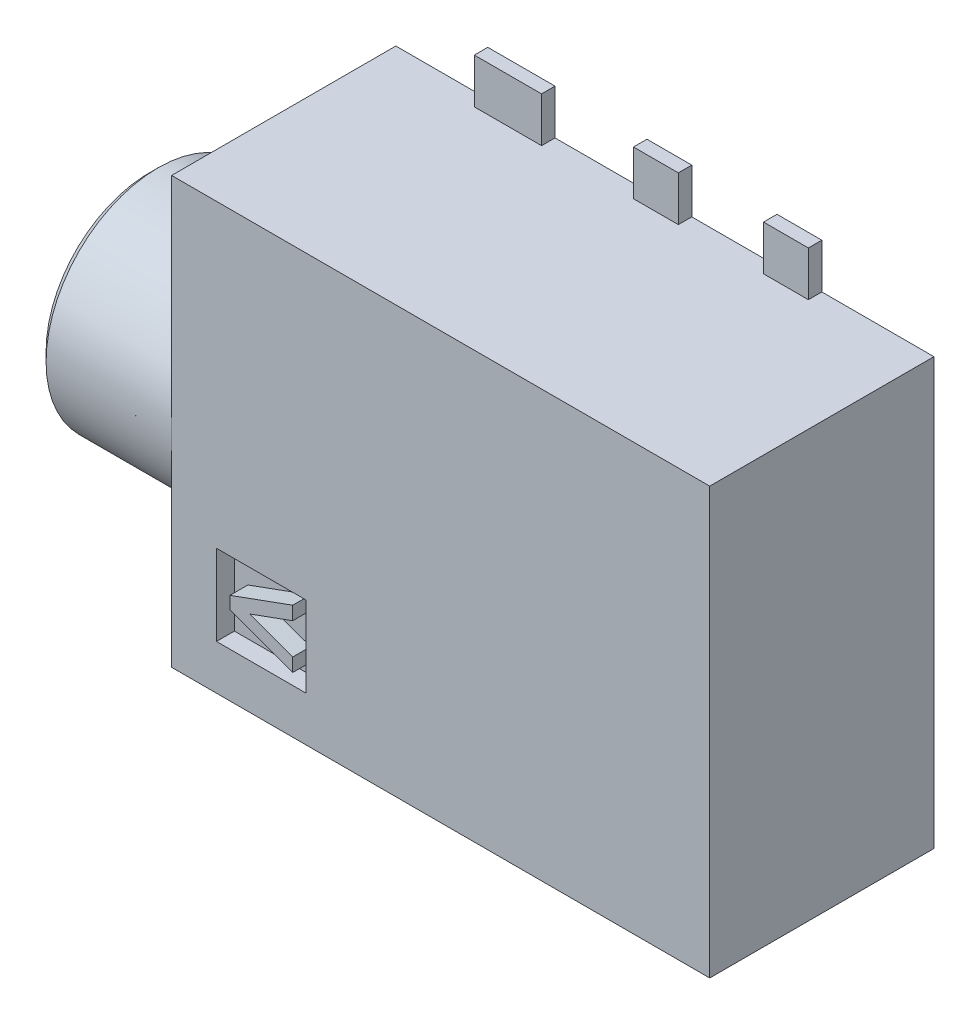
ISO-10303-21;
HEADER;
FILE_DESCRIPTION(('STEP AP214'),'2;1');
FILE_NAME('part.step','',(''),(''),'','','');
FILE_SCHEMA(('AUTOMOTIVE_DESIGN { 1 0 10303 214 1 1 1 1 }'));
ENDSEC;
DATA;
#1=APPLICATION_CONTEXT('core data for automotive mechanical design processes');
#2=APPLICATION_PROTOCOL_DEFINITION('international standard','automotive_design',2000,#1);
#3=PRODUCT_CONTEXT('',#1,'mechanical');
#4=PRODUCT('Part','Part','',(#3));
#5=PRODUCT_RELATED_PRODUCT_CATEGORY('part','',(#4));
#6=PRODUCT_DEFINITION_FORMATION('','',#4);
#7=PRODUCT_DEFINITION_CONTEXT('part definition',#1,'design');
#8=PRODUCT_DEFINITION('design','',#6,#7);
#9=PRODUCT_DEFINITION_SHAPE('','',#8);
#10=(LENGTH_UNIT() NAMED_UNIT(*) SI_UNIT(.MILLI.,.METRE.));
#11=(NAMED_UNIT(*) PLANE_ANGLE_UNIT() SI_UNIT($,.RADIAN.));
#12=(NAMED_UNIT(*) SI_UNIT($,.STERADIAN.) SOLID_ANGLE_UNIT());
#13=UNCERTAINTY_MEASURE_WITH_UNIT(LENGTH_MEASURE(1.E-05),#10,'distance_accuracy_value','');
#14=(GEOMETRIC_REPRESENTATION_CONTEXT(3) GLOBAL_UNCERTAINTY_ASSIGNED_CONTEXT((#13)) GLOBAL_UNIT_ASSIGNED_CONTEXT((#10,
#11,#12)) REPRESENTATION_CONTEXT('',''));
#15=CARTESIAN_POINT('',(0.,0.,0.));
#16=DIRECTION('',(0.,0.,1.));
#17=DIRECTION('',(1.,0.,0.));
#18=AXIS2_PLACEMENT_3D('',#15,#16,#17);
#19=CARTESIAN_POINT('',(11.,2.6784,0.6784));
#20=DIRECTION('',(-1.,0.,0.));
#21=DIRECTION('',(0.,0.,1.));
#22=AXIS2_PLACEMENT_3D('',#19,#20,#21);
#23=PLANE('',#22);
#24=CARTESIAN_POINT('',(11.,4.5,2.5));
#25=DIRECTION('',(1.,0.,0.));
#26=DIRECTION('',(0.,0.,-1.));
#27=AXIS2_PLACEMENT_3D('',#24,#25,#26);
#28=CIRCLE('',#27,1.8);
#29=CARTESIAN_POINT('',(11.,4.5,0.7));
#30=VERTEX_POINT('',#29);
#31=EDGE_CURVE('E20',#30,#30,#28,.T.);
#32=ORIENTED_EDGE('',*,*,#31,.F.);
#33=EDGE_LOOP('',(#32));
#34=FACE_BOUND('',#33,.T.);
#35=ADVANCED_FACE('F16',(#34),#23,.T.);
#36=CARTESIAN_POINT('',(-2.8,4.5,2.5));
#37=DIRECTION('',(1.,0.,0.));
#38=DIRECTION('',(0.,0.,-1.));
#39=AXIS2_PLACEMENT_3D('',#36,#37,#38);
#40=CYLINDRICAL_SURFACE('',#39,1.8);
#41=CARTESIAN_POINT('',(-2.79999999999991,4.5,2.5));
#42=DIRECTION('',(-1.,0.,0.));
#43=DIRECTION('',(0.,0.,1.));
#44=AXIS2_PLACEMENT_3D('',#41,#42,#43);
#45=CIRCLE('',#44,1.8);
#46=CARTESIAN_POINT('',(-2.8,4.5,4.3));
#47=VERTEX_POINT('',#46);
#48=EDGE_CURVE('E335',#47,#47,#45,.F.);
#49=ORIENTED_EDGE('',*,*,#48,.F.);
#50=EDGE_LOOP('',(#49));
#51=FACE_BOUND('',#50,.T.);
#52=ORIENTED_EDGE('',*,*,#31,.T.);
#53=EDGE_LOOP('',(#52));
#54=FACE_BOUND('',#53,.T.);
#55=ADVANCED_FACE('F758',(#51,#54),#40,.F.);
#56=CARTESIAN_POINT('',(2.7,1.25,5.));
#57=DIRECTION('',(0.,0.,-1.));
#58=DIRECTION('',(-1.,0.,0.));
#59=AXIS2_PLACEMENT_3D('',#56,#57,#58);
#60=PLANE('',#59);
#61=DIRECTION('',(0.939692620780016,0.342020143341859,0.));
#62=VECTOR('',#61,1.);
#63=CARTESIAN_POINT('',(2.,2.295220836,5.));
#64=LINE('',#63,#62);
#65=CARTESIAN_POINT('',(1.3,2.04044167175,5.));
#66=VERTEX_POINT('',#65);
#67=CARTESIAN_POINT('',(2.7,2.55,5.));
#68=VERTEX_POINT('',#67);
#69=EDGE_CURVE('E317',#66,#68,#64,.T.);
#70=ORIENTED_EDGE('',*,*,#69,.F.);
#71=DIRECTION('',(0.,1.,0.));
#72=VECTOR('',#71,1.);
#73=CARTESIAN_POINT('',(1.3,1.9,5.));
#74=LINE('',#73,#72);
#75=CARTESIAN_POINT('',(1.3,1.75955832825,5.));
#76=VERTEX_POINT('',#75);
#77=EDGE_CURVE('E318',#76,#66,#74,.T.);
#78=ORIENTED_EDGE('',*,*,#77,.F.);
#79=DIRECTION('',(-0.939692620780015,0.342020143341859,0.));
#80=VECTOR('',#79,1.);
#81=CARTESIAN_POINT('',(2.,1.504779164,5.));
#82=LINE('',#81,#80);
#83=CARTESIAN_POINT('',(2.7,1.25,5.));
#84=VERTEX_POINT('',#83);
#85=EDGE_CURVE('E322',#84,#76,#82,.T.);
#86=ORIENTED_EDGE('',*,*,#85,.F.);
#87=DIRECTION('',(0.,-1.,0.));
#88=VECTOR('',#87,1.);
#89=CARTESIAN_POINT('',(2.7,1.4,5.));
#90=LINE('',#89,#88);
#91=CARTESIAN_POINT('',(2.7,1.55000000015,5.));
#92=VERTEX_POINT('',#91);
#93=EDGE_CURVE('E260',#92,#84,#90,.T.);
#94=ORIENTED_EDGE('',*,*,#93,.F.);
#95=DIRECTION('',(0.939692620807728,-0.342020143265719,0.));
#96=VECTOR('',#95,1.);
#97=CARTESIAN_POINT('',(2.2191914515,1.725,5.));
#98=LINE('',#97,#96);
#99=CARTESIAN_POINT('',(1.73838290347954,1.90000000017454,5.));
#100=VERTEX_POINT('',#99);
#101=EDGE_CURVE('E261',#100,#92,#98,.T.);
#102=ORIENTED_EDGE('',*,*,#101,.F.);
#103=DIRECTION('',(-0.939692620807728,-0.342020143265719,0.));
#104=VECTOR('',#103,1.);
#105=CARTESIAN_POINT('',(2.2191914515,2.075,5.));
#106=LINE('',#105,#104);
#107=CARTESIAN_POINT('',(2.7,2.24999999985,5.));
#108=VERTEX_POINT('',#107);
#109=EDGE_CURVE('E257',#108,#100,#106,.T.);
#110=ORIENTED_EDGE('',*,*,#109,.F.);
#111=DIRECTION('',(0.,-1.,0.));
#112=VECTOR('',#111,1.);
#113=CARTESIAN_POINT('',(2.7,1.9,5.));
#114=LINE('',#113,#112);
#115=EDGE_CURVE('E338',#68,#108,#114,.T.);
#116=ORIENTED_EDGE('',*,*,#115,.F.);
#117=EDGE_LOOP('',(#70,#78,#86,#94,#102,#110,#116));
#118=FACE_BOUND('',#117,.T.);
#119=ADVANCED_FACE('F756',(#118),#60,.F.);
#120=CARTESIAN_POINT('',(-2.8,4.5,2.5));
#121=DIRECTION('',(-1.,0.,0.));
#122=DIRECTION('',(0.,0.,1.));
#123=AXIS2_PLACEMENT_3D('',#120,#121,#122);
#124=CONICAL_SURFACE('',#123,1.8,0.785398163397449);
#125=ORIENTED_EDGE('',*,*,#48,.T.);
#126=EDGE_LOOP('',(#125));
#127=FACE_BOUND('',#126,.T.);
#128=CARTESIAN_POINT('',(-2.99999999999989,4.5,2.5));
#129=DIRECTION('',(-1.,0.,0.));
#130=DIRECTION('',(0.,0.,1.));
#131=AXIS2_PLACEMENT_3D('',#128,#129,#130);
#132=CIRCLE('',#131,1.99999999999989);
#133=CARTESIAN_POINT('',(-2.99999999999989,4.5,4.49999999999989));
#134=VERTEX_POINT('',#133);
#135=EDGE_CURVE('E279',#134,#134,#132,.F.);
#136=ORIENTED_EDGE('',*,*,#135,.F.);
#137=EDGE_LOOP('',(#136));
#138=FACE_BOUND('',#137,.T.);
#139=ADVANCED_FACE('F753',(#127,#138),#124,.F.);
#140=CARTESIAN_POINT('',(1.738382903,1.9,4.6));
#141=DIRECTION('',(0.34202014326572,-0.939692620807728,0.));
#142=DIRECTION('',(0.939692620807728,0.34202014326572,0.));
#143=AXIS2_PLACEMENT_3D('',#140,#141,#142);
#144=PLANE('',#143);
#145=DIRECTION('',(-0.93969262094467,-0.342020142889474,0.));
#146=VECTOR('',#145,1.);
#147=CARTESIAN_POINT('',(2.7,2.2499999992,4.6));
#148=LINE('',#147,#146);
#149=CARTESIAN_POINT('',(2.7,2.2499999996,4.6));
#150=VERTEX_POINT('',#149);
#151=CARTESIAN_POINT('',(1.73838290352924,1.89999999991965,4.6));
#152=VERTEX_POINT('',#151);
#153=EDGE_CURVE('E249',#150,#152,#148,.T.);
#154=ORIENTED_EDGE('',*,*,#153,.F.);
#155=DIRECTION('',(0.,0.,-1.));
#156=VECTOR('',#155,1.);
#157=CARTESIAN_POINT('',(2.7,2.25,4.8));
#158=LINE('',#157,#156);
#159=EDGE_CURVE('E325',#108,#150,#158,.T.);
#160=ORIENTED_EDGE('',*,*,#159,.F.);
#161=ORIENTED_EDGE('',*,*,#109,.T.);
#162=DIRECTION('',(0.,0.,1.));
#163=VECTOR('',#162,1.);
#164=CARTESIAN_POINT('',(1.738382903,1.9,4.8));
#165=LINE('',#164,#163);
#166=EDGE_CURVE('E253',#152,#100,#165,.T.);
#167=ORIENTED_EDGE('',*,*,#166,.F.);
#168=EDGE_LOOP('',(#154,#160,#161,#167));
#169=FACE_BOUND('',#168,.T.);
#170=ADVANCED_FACE('F255',(#169),#144,.T.);
#171=CARTESIAN_POINT('',(2.7,1.55,4.6));
#172=DIRECTION('',(0.342020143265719,0.939692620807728,0.));
#173=DIRECTION('',(-0.939692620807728,0.342020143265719,0.));
#174=AXIS2_PLACEMENT_3D('',#171,#172,#173);
#175=PLANE('',#174);
#176=DIRECTION('',(0.93969262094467,-0.342020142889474,0.));
#177=VECTOR('',#176,1.);
#178=CARTESIAN_POINT('',(1.738382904,1.9,4.6));
#179=LINE('',#178,#177);
#180=CARTESIAN_POINT('',(2.7,1.5500000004,4.6));
#181=VERTEX_POINT('',#180);
#182=EDGE_CURVE('E264',#152,#181,#179,.T.);
#183=ORIENTED_EDGE('',*,*,#182,.F.);
#184=ORIENTED_EDGE('',*,*,#166,.T.);
#185=ORIENTED_EDGE('',*,*,#101,.T.);
#186=DIRECTION('',(0.,0.,1.));
#187=VECTOR('',#186,1.);
#188=CARTESIAN_POINT('',(2.7,1.55,4.8));
#189=LINE('',#188,#187);
#190=EDGE_CURVE('E267',#181,#92,#189,.T.);
#191=ORIENTED_EDGE('',*,*,#190,.F.);
#192=EDGE_LOOP('',(#183,#184,#185,#191));
#193=FACE_BOUND('',#192,.T.);
#194=ADVANCED_FACE('F265',(#193),#175,.T.);
#195=CARTESIAN_POINT('',(2.7,1.25,5.));
#196=DIRECTION('',(1.,0.,0.));
#197=DIRECTION('',(0.,0.,-1.));
#198=AXIS2_PLACEMENT_3D('',#195,#196,#197);
#199=PLANE('',#198);
#200=DIRECTION('',(0.,-1.,0.));
#201=VECTOR('',#200,1.);
#202=CARTESIAN_POINT('',(2.7,1.9,4.6));
#203=LINE('',#202,#201);
#204=CARTESIAN_POINT('',(2.7,1.2500000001,4.6));
#205=VERTEX_POINT('',#204);
#206=EDGE_CURVE('E271',#181,#205,#203,.T.);
#207=ORIENTED_EDGE('',*,*,#206,.F.);
#208=ORIENTED_EDGE('',*,*,#190,.T.);
#209=ORIENTED_EDGE('',*,*,#93,.T.);
#210=DIRECTION('',(0.,0.,1.));
#211=VECTOR('',#210,1.);
#212=CARTESIAN_POINT('',(2.7,1.25,4.8));
#213=LINE('',#212,#211);
#214=EDGE_CURVE('E319',#205,#84,#213,.T.);
#215=ORIENTED_EDGE('',*,*,#214,.F.);
#216=EDGE_LOOP('',(#207,#208,#209,#215));
#217=FACE_BOUND('',#216,.T.);
#218=ADVANCED_FACE('F772',(#217),#199,.T.);
#219=CARTESIAN_POINT('',(1.3,1.759558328,4.6));
#220=DIRECTION('',(-0.342020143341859,-0.939692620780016,0.));
#221=DIRECTION('',(0.939692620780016,-0.342020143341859,0.));
#222=AXIS2_PLACEMENT_3D('',#219,#220,#221);
#223=PLANE('',#222);
#224=DIRECTION('',(-0.939692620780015,0.342020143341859,0.));
#225=VECTOR('',#224,1.);
#226=CARTESIAN_POINT('',(2.7,1.2500000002,4.6));
#227=LINE('',#226,#225);
#228=CARTESIAN_POINT('',(1.3,1.7595583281,4.6));
#229=VERTEX_POINT('',#228);
#230=EDGE_CURVE('E284',#205,#229,#227,.T.);
#231=ORIENTED_EDGE('',*,*,#230,.F.);
#232=ORIENTED_EDGE('',*,*,#214,.T.);
#233=ORIENTED_EDGE('',*,*,#85,.T.);
#234=DIRECTION('',(0.,0.,1.));
#235=VECTOR('',#234,1.);
#236=CARTESIAN_POINT('',(1.3,1.759558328,4.8));
#237=LINE('',#236,#235);
#238=EDGE_CURVE('E314',#229,#76,#237,.T.);
#239=ORIENTED_EDGE('',*,*,#238,.F.);
#240=EDGE_LOOP('',(#231,#232,#233,#239));
#241=FACE_BOUND('',#240,.T.);
#242=ADVANCED_FACE('F775',(#241),#223,.T.);
#243=CARTESIAN_POINT('',(1.3,1.759558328,4.6));
#244=DIRECTION('',(-1.,0.,0.));
#245=DIRECTION('',(0.,0.,1.));
#246=AXIS2_PLACEMENT_3D('',#243,#244,#245);
#247=PLANE('',#246);
#248=DIRECTION('',(0.,1.,0.));
#249=VECTOR('',#248,1.);
#250=CARTESIAN_POINT('',(1.3,1.9,4.6));
#251=LINE('',#250,#249);
#252=CARTESIAN_POINT('',(1.3,2.0404416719,4.6));
#253=VERTEX_POINT('',#252);
#254=EDGE_CURVE('E287',#229,#253,#251,.T.);
#255=ORIENTED_EDGE('',*,*,#254,.F.);
#256=ORIENTED_EDGE('',*,*,#238,.T.);
#257=ORIENTED_EDGE('',*,*,#77,.T.);
#258=DIRECTION('',(0.,0.,1.));
#259=VECTOR('',#258,1.);
#260=CARTESIAN_POINT('',(1.3,2.040441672,4.8));
#261=LINE('',#260,#259);
#262=EDGE_CURVE('E327',#253,#66,#261,.T.);
#263=ORIENTED_EDGE('',*,*,#262,.F.);
#264=EDGE_LOOP('',(#255,#256,#257,#263));
#265=FACE_BOUND('',#264,.T.);
#266=ADVANCED_FACE('F779',(#265),#247,.T.);
#267=CARTESIAN_POINT('',(2.7,2.55,4.6));
#268=DIRECTION('',(-0.342020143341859,0.939692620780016,0.));
#269=DIRECTION('',(-0.939692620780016,-0.342020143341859,0.));
#270=AXIS2_PLACEMENT_3D('',#267,#268,#269);
#271=PLANE('',#270);
#272=DIRECTION('',(0.939692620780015,0.342020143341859,0.));
#273=VECTOR('',#272,1.);
#274=CARTESIAN_POINT('',(1.3,2.0404416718,4.6));
#275=LINE('',#274,#273);
#276=CARTESIAN_POINT('',(2.7,2.5499999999,4.6));
#277=VERTEX_POINT('',#276);
#278=EDGE_CURVE('E288',#253,#277,#275,.T.);
#279=ORIENTED_EDGE('',*,*,#278,.F.);
#280=ORIENTED_EDGE('',*,*,#262,.T.);
#281=ORIENTED_EDGE('',*,*,#69,.T.);
#282=DIRECTION('',(0.,0.,1.));
#283=VECTOR('',#282,1.);
#284=CARTESIAN_POINT('',(2.7,2.55,4.8));
#285=LINE('',#284,#283);
#286=EDGE_CURVE('E282',#277,#68,#285,.T.);
#287=ORIENTED_EDGE('',*,*,#286,.F.);
#288=EDGE_LOOP('',(#279,#280,#281,#287));
#289=FACE_BOUND('',#288,.T.);
#290=ADVANCED_FACE('F783',(#289),#271,.T.);
#291=CARTESIAN_POINT('',(2.7,2.25,5.));
#292=DIRECTION('',(1.,0.,0.));
#293=DIRECTION('',(0.,0.,-1.));
#294=AXIS2_PLACEMENT_3D('',#291,#292,#293);
#295=PLANE('',#294);
#296=DIRECTION('',(0.,-1.,0.));
#297=VECTOR('',#296,1.);
#298=CARTESIAN_POINT('',(2.7,1.9,4.6));
#299=LINE('',#298,#297);
#300=EDGE_CURVE('E278',#277,#150,#299,.T.);
#301=ORIENTED_EDGE('',*,*,#300,.F.);
#302=ORIENTED_EDGE('',*,*,#286,.T.);
#303=ORIENTED_EDGE('',*,*,#115,.T.);
#304=ORIENTED_EDGE('',*,*,#159,.T.);
#305=EDGE_LOOP('',(#301,#302,#303,#304));
#306=FACE_BOUND('',#305,.T.);
#307=ADVANCED_FACE('F787',(#306),#295,.T.);
#308=CARTESIAN_POINT('',(-3.,2.1724,0.1724));
#309=DIRECTION('',(-1.,0.,0.));
#310=DIRECTION('',(0.,0.,1.));
#311=AXIS2_PLACEMENT_3D('',#308,#309,#310);
#312=PLANE('',#311);
#313=ORIENTED_EDGE('',*,*,#135,.T.);
#314=EDGE_LOOP('',(#313));
#315=FACE_BOUND('',#314,.T.);
#316=CARTESIAN_POINT('',(-2.99999999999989,4.5,2.5));
#317=DIRECTION('',(1.,0.,0.));
#318=DIRECTION('',(0.,0.,-1.));
#319=AXIS2_PLACEMENT_3D('',#316,#317,#318);
#320=CIRCLE('',#319,2.30000000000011);
#321=CARTESIAN_POINT('',(-2.99999999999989,4.5,0.199999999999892));
#322=VERTEX_POINT('',#321);
#323=EDGE_CURVE('E290',#322,#322,#320,.F.);
#324=ORIENTED_EDGE('',*,*,#323,.T.);
#325=EDGE_LOOP('',(#324));
#326=FACE_BOUND('',#325,.T.);
#327=ADVANCED_FACE('F791',(#315,#326),#312,.T.);
#328=CARTESIAN_POINT('',(1.,1.,4.6));
#329=DIRECTION('',(0.,0.,1.));
#330=DIRECTION('',(1.,0.,0.));
#331=AXIS2_PLACEMENT_3D('',#328,#329,#330);
#332=PLANE('',#331);
#333=ORIENTED_EDGE('',*,*,#278,.T.);
#334=ORIENTED_EDGE('',*,*,#300,.T.);
#335=ORIENTED_EDGE('',*,*,#153,.T.);
#336=ORIENTED_EDGE('',*,*,#182,.T.);
#337=ORIENTED_EDGE('',*,*,#206,.T.);
#338=ORIENTED_EDGE('',*,*,#230,.T.);
#339=ORIENTED_EDGE('',*,*,#254,.T.);
#340=EDGE_LOOP('',(#333,#334,#335,#336,#337,#338,#339));
#341=FACE_BOUND('',#340,.T.);
#342=DIRECTION('',(0.,1.,0.));
#343=VECTOR('',#342,1.);
#344=CARTESIAN_POINT('',(3.,1.9,4.6));
#345=LINE('',#344,#343);
#346=CARTESIAN_POINT('',(3.,1.,4.6));
#347=VERTEX_POINT('',#346);
#348=CARTESIAN_POINT('',(3.,2.8,4.6));
#349=VERTEX_POINT('',#348);
#350=EDGE_CURVE('E293',#347,#349,#345,.T.);
#351=ORIENTED_EDGE('',*,*,#350,.T.);
#352=DIRECTION('',(-1.,0.,0.));
#353=VECTOR('',#352,1.);
#354=CARTESIAN_POINT('',(2.,2.8,4.6));
#355=LINE('',#354,#353);
#356=CARTESIAN_POINT('',(1.,2.8,4.6));
#357=VERTEX_POINT('',#356);
#358=EDGE_CURVE('E359',#349,#357,#355,.T.);
#359=ORIENTED_EDGE('',*,*,#358,.T.);
#360=DIRECTION('',(0.,-1.,0.));
#361=VECTOR('',#360,1.);
#362=CARTESIAN_POINT('',(1.,1.9,4.6));
#363=LINE('',#362,#361);
#364=CARTESIAN_POINT('',(1.,1.,4.6));
#365=VERTEX_POINT('',#364);
#366=EDGE_CURVE('E364',#357,#365,#363,.T.);
#367=ORIENTED_EDGE('',*,*,#366,.T.);
#368=DIRECTION('',(1.,0.,0.));
#369=VECTOR('',#368,1.);
#370=CARTESIAN_POINT('',(2.,1.,4.6));
#371=LINE('',#370,#369);
#372=EDGE_CURVE('E369',#365,#347,#371,.T.);
#373=ORIENTED_EDGE('',*,*,#372,.T.);
#374=EDGE_LOOP('',(#351,#359,#367,#373));
#375=FACE_BOUND('',#374,.T.);
#376=ADVANCED_FACE('F275',(#341,#375),#332,.T.);
#377=CARTESIAN_POINT('',(-3.,4.5,2.5));
#378=DIRECTION('',(1.,0.,0.));
#379=DIRECTION('',(0.,0.,-1.));
#380=AXIS2_PLACEMENT_3D('',#377,#378,#379);
#381=CONICAL_SURFACE('',#380,2.3,0.785398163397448);
#382=CARTESIAN_POINT('',(-2.8,4.5,2.5));
#383=DIRECTION('',(1.,0.,0.));
#384=DIRECTION('',(0.,0.,-1.));
#385=AXIS2_PLACEMENT_3D('',#382,#383,#384);
#386=CIRCLE('',#385,2.5);
#387=CARTESIAN_POINT('',(-2.8,4.5,0.));
#388=VERTEX_POINT('',#387);
#389=EDGE_CURVE('E350',#388,#388,#386,.F.);
#390=ORIENTED_EDGE('',*,*,#389,.T.);
#391=EDGE_LOOP('',(#390));
#392=FACE_BOUND('',#391,.T.);
#393=ORIENTED_EDGE('',*,*,#323,.F.);
#394=EDGE_LOOP('',(#393));
#395=FACE_BOUND('',#394,.T.);
#396=ADVANCED_FACE('F748',(#392,#395),#381,.T.);
#397=CARTESIAN_POINT('',(3.,1.,5.));
#398=DIRECTION('',(1.,0.,0.));
#399=DIRECTION('',(0.,0.,-1.));
#400=AXIS2_PLACEMENT_3D('',#397,#398,#399);
#401=PLANE('',#400);
#402=DIRECTION('',(0.,0.,-1.));
#403=VECTOR('',#402,1.);
#404=CARTESIAN_POINT('',(3.,2.8,4.8));
#405=LINE('',#404,#403);
#406=CARTESIAN_POINT('',(3.,2.79999999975,5.));
#407=VERTEX_POINT('',#406);
#408=EDGE_CURVE('E356',#407,#349,#405,.T.);
#409=ORIENTED_EDGE('',*,*,#408,.T.);
#410=ORIENTED_EDGE('',*,*,#350,.F.);
#411=DIRECTION('',(0.,0.,1.));
#412=VECTOR('',#411,1.);
#413=CARTESIAN_POINT('',(3.,1.,4.8));
#414=LINE('',#413,#412);
#415=CARTESIAN_POINT('',(3.,1.00000000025,5.));
#416=VERTEX_POINT('',#415);
#417=EDGE_CURVE('E354',#347,#416,#414,.T.);
#418=ORIENTED_EDGE('',*,*,#417,.T.);
#419=DIRECTION('',(0.,1.,0.));
#420=VECTOR('',#419,1.);
#421=CARTESIAN_POINT('',(3.,4.75,5.));
#422=LINE('',#421,#420);
#423=EDGE_CURVE('E353',#416,#407,#422,.T.);
#424=ORIENTED_EDGE('',*,*,#423,.T.);
#425=EDGE_LOOP('',(#409,#410,#418,#424));
#426=FACE_BOUND('',#425,.T.);
#427=ADVANCED_FACE('F751',(#426),#401,.F.);
#428=CARTESIAN_POINT('',(3.,2.8,4.6));
#429=DIRECTION('',(0.,1.,0.));
#430=DIRECTION('',(-1.,0.,0.));
#431=AXIS2_PLACEMENT_3D('',#428,#429,#430);
#432=PLANE('',#431);
#433=DIRECTION('',(0.,0.,-1.));
#434=VECTOR('',#433,1.);
#435=CARTESIAN_POINT('',(1.,2.8,4.8));
#436=LINE('',#435,#434);
#437=CARTESIAN_POINT('',(0.999999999,2.79999999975,5.));
#438=VERTEX_POINT('',#437);
#439=EDGE_CURVE('E361',#438,#357,#436,.T.);
#440=ORIENTED_EDGE('',*,*,#439,.T.);
#441=ORIENTED_EDGE('',*,*,#358,.F.);
#442=ORIENTED_EDGE('',*,*,#408,.F.);
#443=DIRECTION('',(-1.,0.,0.));
#444=VECTOR('',#443,1.);
#445=CARTESIAN_POINT('',(6.,2.799999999,5.));
#446=LINE('',#445,#444);
#447=EDGE_CURVE('E433',#407,#438,#446,.T.);
#448=ORIENTED_EDGE('',*,*,#447,.T.);
#449=EDGE_LOOP('',(#440,#441,#442,#448));
#450=FACE_BOUND('',#449,.T.);
#451=ADVANCED_FACE('F800',(#450),#432,.F.);
#452=CARTESIAN_POINT('',(1.,1.,4.6));
#453=DIRECTION('',(-1.,0.,0.));
#454=DIRECTION('',(0.,0.,1.));
#455=AXIS2_PLACEMENT_3D('',#452,#453,#454);
#456=PLANE('',#455);
#457=DIRECTION('',(0.,0.,-1.));
#458=VECTOR('',#457,1.);
#459=CARTESIAN_POINT('',(1.,1.,4.8));
#460=LINE('',#459,#458);
#461=CARTESIAN_POINT('',(0.999999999,1.00000000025,5.));
#462=VERTEX_POINT('',#461);
#463=EDGE_CURVE('E366',#462,#365,#460,.T.);
#464=ORIENTED_EDGE('',*,*,#463,.T.);
#465=ORIENTED_EDGE('',*,*,#366,.F.);
#466=ORIENTED_EDGE('',*,*,#439,.F.);
#467=DIRECTION('',(0.,-1.,0.));
#468=VECTOR('',#467,1.);
#469=CARTESIAN_POINT('',(0.999999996,4.75,5.));
#470=LINE('',#469,#468);
#471=EDGE_CURVE('E435',#438,#462,#470,.T.);
#472=ORIENTED_EDGE('',*,*,#471,.T.);
#473=EDGE_LOOP('',(#464,#465,#466,#472));
#474=FACE_BOUND('',#473,.T.);
#475=ADVANCED_FACE('F804',(#474),#456,.F.);
#476=CARTESIAN_POINT('',(1.,1.,5.));
#477=DIRECTION('',(0.,-1.,0.));
#478=DIRECTION('',(0.,0.,-1.));
#479=AXIS2_PLACEMENT_3D('',#476,#477,#478);
#480=PLANE('',#479);
#481=ORIENTED_EDGE('',*,*,#417,.F.);
#482=ORIENTED_EDGE('',*,*,#372,.F.);
#483=ORIENTED_EDGE('',*,*,#463,.F.);
#484=DIRECTION('',(1.,0.,0.));
#485=VECTOR('',#484,1.);
#486=CARTESIAN_POINT('',(6.,1.000000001,5.));
#487=LINE('',#486,#485);
#488=EDGE_CURVE('E298',#462,#416,#487,.T.);
#489=ORIENTED_EDGE('',*,*,#488,.T.);
#490=EDGE_LOOP('',(#481,#482,#483,#489));
#491=FACE_BOUND('',#490,.T.);
#492=ADVANCED_FACE('F808',(#491),#480,.F.);
#493=CARTESIAN_POINT('',(2.4434,3.9434,-0.6));
#494=DIRECTION('',(0.,0.,1.));
#495=DIRECTION('',(1.,0.,0.));
#496=AXIS2_PLACEMENT_3D('',#493,#494,#495);
#497=PLANE('',#496);
#498=CARTESIAN_POINT('',(3.,4.5,-0.600000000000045));
#499=DIRECTION('',(0.,0.,1.));
#500=DIRECTION('',(1.,0.,0.));
#501=AXIS2_PLACEMENT_3D('',#498,#499,#500);
#502=CIRCLE('',#501,0.549999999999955);
#503=CARTESIAN_POINT('',(3.54999999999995,4.5,-0.600000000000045));
#504=VERTEX_POINT('',#503);
#505=EDGE_CURVE('E294',#504,#504,#502,.F.);
#506=ORIENTED_EDGE('',*,*,#505,.T.);
#507=EDGE_LOOP('',(#506));
#508=FACE_BOUND('',#507,.T.);
#509=ADVANCED_FACE('F812',(#508),#497,.F.);
#510=CARTESIAN_POINT('',(4.4,-1.5,0.3));
#511=DIRECTION('',(0.,0.,1.));
#512=DIRECTION('',(1.,0.,0.));
#513=AXIS2_PLACEMENT_3D('',#510,#511,#512);
#514=PLANE('',#513);
#515=DIRECTION('',(1.,0.,0.));
#516=VECTOR('',#515,1.);
#517=CARTESIAN_POINT('',(4.9,-1.5,0.3));
#518=LINE('',#517,#516);
#519=CARTESIAN_POINT('',(4.4,-1.5,0.3));
#520=VERTEX_POINT('',#519);
#521=CARTESIAN_POINT('',(5.4,-1.5,0.3));
#522=VERTEX_POINT('',#521);
#523=EDGE_CURVE('E379',#520,#522,#518,.T.);
#524=ORIENTED_EDGE('',*,*,#523,.T.);
#525=DIRECTION('',(0.,1.,0.));
#526=VECTOR('',#525,1.);
#527=CARTESIAN_POINT('',(5.4,-0.75,0.3));
#528=LINE('',#527,#526);
#529=CARTESIAN_POINT('',(5.4,0.,0.3));
#530=VERTEX_POINT('',#529);
#531=EDGE_CURVE('E382',#522,#530,#528,.T.);
#532=ORIENTED_EDGE('',*,*,#531,.T.);
#533=DIRECTION('',(-1.,0.,0.));
#534=VECTOR('',#533,1.);
#535=CARTESIAN_POINT('',(6.,0.,0.3));
#536=LINE('',#535,#534);
#537=CARTESIAN_POINT('',(4.40000000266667,0.,0.3));
#538=VERTEX_POINT('',#537);
#539=EDGE_CURVE('E389',#530,#538,#536,.T.);
#540=ORIENTED_EDGE('',*,*,#539,.T.);
#541=DIRECTION('',(0.,-1.,0.));
#542=VECTOR('',#541,1.);
#543=CARTESIAN_POINT('',(4.4,-0.75,0.3));
#544=LINE('',#543,#542);
#545=EDGE_CURVE('E395',#538,#520,#544,.T.);
#546=ORIENTED_EDGE('',*,*,#545,.T.);
#547=EDGE_LOOP('',(#524,#532,#540,#546));
#548=FACE_BOUND('',#547,.T.);
#549=ADVANCED_FACE('F816',(#548),#514,.T.);
#550=CARTESIAN_POINT('',(8.55,-1.5,0.3));
#551=DIRECTION('',(0.,0.,1.));
#552=DIRECTION('',(1.,0.,0.));
#553=AXIS2_PLACEMENT_3D('',#550,#551,#552);
#554=PLANE('',#553);
#555=DIRECTION('',(1.,0.,0.));
#556=VECTOR('',#555,1.);
#557=CARTESIAN_POINT('',(9.3,-1.5,0.3));
#558=LINE('',#557,#556);
#559=CARTESIAN_POINT('',(8.55,-1.5,0.3));
#560=VERTEX_POINT('',#559);
#561=CARTESIAN_POINT('',(10.05,-1.5,0.3));
#562=VERTEX_POINT('',#561);
#563=EDGE_CURVE('E374',#560,#562,#558,.T.);
#564=ORIENTED_EDGE('',*,*,#563,.T.);
#565=DIRECTION('',(0.,1.,0.));
#566=VECTOR('',#565,1.);
#567=CARTESIAN_POINT('',(10.05,-0.75,0.3));
#568=LINE('',#567,#566);
#569=CARTESIAN_POINT('',(10.05,0.,0.3));
#570=VERTEX_POINT('',#569);
#571=EDGE_CURVE('E297',#562,#570,#568,.T.);
#572=ORIENTED_EDGE('',*,*,#571,.T.);
#573=DIRECTION('',(-1.,0.,0.));
#574=VECTOR('',#573,1.);
#575=CARTESIAN_POINT('',(6.,0.,0.3));
#576=LINE('',#575,#574);
#577=CARTESIAN_POINT('',(8.55,0.,0.3));
#578=VERTEX_POINT('',#577);
#579=EDGE_CURVE('E404',#570,#578,#576,.T.);
#580=ORIENTED_EDGE('',*,*,#579,.T.);
#581=DIRECTION('',(0.,-1.,0.));
#582=VECTOR('',#581,1.);
#583=CARTESIAN_POINT('',(8.55,-0.75,0.3));
#584=LINE('',#583,#582);
#585=EDGE_CURVE('E386',#578,#560,#584,.T.);
#586=ORIENTED_EDGE('',*,*,#585,.T.);
#587=EDGE_LOOP('',(#564,#572,#580,#586));
#588=FACE_BOUND('',#587,.T.);
#589=ADVANCED_FACE('F747',(#588),#554,.T.);
#590=CARTESIAN_POINT('',(-2.8,4.5,2.5));
#591=DIRECTION('',(1.,0.,0.));
#592=DIRECTION('',(0.,0.,-1.));
#593=AXIS2_PLACEMENT_3D('',#590,#591,#592);
#594=CYLINDRICAL_SURFACE('',#593,2.5);
#595=CARTESIAN_POINT('',(0.,4.5,2.5));
#596=DIRECTION('',(1.,0.,0.));
#597=DIRECTION('',(0.,0.,-1.));
#598=AXIS2_PLACEMENT_3D('',#595,#596,#597);
#599=CIRCLE('',#598,2.5);
#600=CARTESIAN_POINT('',(0.,4.50000000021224,5.));
#601=VERTEX_POINT('',#600);
#602=CARTESIAN_POINT('',(0.,4.5,0.));
#603=VERTEX_POINT('',#602);
#604=EDGE_CURVE('E304',#601,#603,#599,.F.);
#605=ORIENTED_EDGE('',*,*,#604,.T.);
#606=CARTESIAN_POINT('',(0.,4.5,2.5));
#607=DIRECTION('',(1.,0.,0.));
#608=DIRECTION('',(0.,0.,-1.));
#609=AXIS2_PLACEMENT_3D('',#606,#607,#608);
#610=CIRCLE('',#609,2.5);
#611=EDGE_CURVE('E299',#603,#601,#610,.F.);
#612=ORIENTED_EDGE('',*,*,#611,.T.);
#613=EDGE_LOOP('',(#605,#612));
#614=FACE_BOUND('',#613,.T.);
#615=ORIENTED_EDGE('',*,*,#389,.F.);
#616=EDGE_LOOP('',(#615));
#617=FACE_BOUND('',#616,.T.);
#618=ADVANCED_FACE('F699',(#614,#617),#594,.T.);
#619=CARTESIAN_POINT('',(8.5,9.5,0.3));
#620=DIRECTION('',(0.,0.,1.));
#621=DIRECTION('',(1.,0.,0.));
#622=AXIS2_PLACEMENT_3D('',#619,#620,#621);
#623=PLANE('',#622);
#624=DIRECTION('',(-1.,0.,0.));
#625=VECTOR('',#624,1.);
#626=CARTESIAN_POINT('',(9.,10.5,0.3));
#627=LINE('',#626,#625);
#628=CARTESIAN_POINT('',(9.5,10.5,0.3));
#629=VERTEX_POINT('',#628);
#630=CARTESIAN_POINT('',(8.5,10.5,0.3));
#631=VERTEX_POINT('',#630);
#632=EDGE_CURVE('E576',#629,#631,#627,.T.);
#633=ORIENTED_EDGE('',*,*,#632,.T.);
#634=DIRECTION('',(0.,-1.,0.));
#635=VECTOR('',#634,1.);
#636=CARTESIAN_POINT('',(8.5,10.,0.3));
#637=LINE('',#636,#635);
#638=CARTESIAN_POINT('',(8.499999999,9.5,0.3));
#639=VERTEX_POINT('',#638);
#640=EDGE_CURVE('E574',#631,#639,#637,.T.);
#641=ORIENTED_EDGE('',*,*,#640,.T.);
#642=DIRECTION('',(1.,0.,0.));
#643=VECTOR('',#642,1.);
#644=CARTESIAN_POINT('',(6.,9.5,0.3));
#645=LINE('',#644,#643);
#646=CARTESIAN_POINT('',(9.500000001,9.5,0.3));
#647=VERTEX_POINT('',#646);
#648=EDGE_CURVE('E585',#639,#647,#645,.T.);
#649=ORIENTED_EDGE('',*,*,#648,.T.);
#650=DIRECTION('',(0.,1.,0.));
#651=VECTOR('',#650,1.);
#652=CARTESIAN_POINT('',(9.5,10.,0.3));
#653=LINE('',#652,#651);
#654=EDGE_CURVE('E582',#647,#629,#653,.T.);
#655=ORIENTED_EDGE('',*,*,#654,.T.);
#656=EDGE_LOOP('',(#633,#641,#649,#655));
#657=FACE_BOUND('',#656,.T.);
#658=ADVANCED_FACE('F650',(#657),#623,.T.);
#659=CARTESIAN_POINT('',(2.05,9.5,0.3));
#660=DIRECTION('',(0.,0.,1.));
#661=DIRECTION('',(1.,0.,0.));
#662=AXIS2_PLACEMENT_3D('',#659,#660,#661);
#663=PLANE('',#662);
#664=DIRECTION('',(-1.,0.,0.));
#665=VECTOR('',#664,1.);
#666=CARTESIAN_POINT('',(2.8,10.5,0.3));
#667=LINE('',#666,#665);
#668=CARTESIAN_POINT('',(3.55,10.5,0.3));
#669=VERTEX_POINT('',#668);
#670=CARTESIAN_POINT('',(2.05,10.5,0.3));
#671=VERTEX_POINT('',#670);
#672=EDGE_CURVE('E554',#669,#671,#667,.T.);
#673=ORIENTED_EDGE('',*,*,#672,.T.);
#674=DIRECTION('',(0.,-1.,0.));
#675=VECTOR('',#674,1.);
#676=CARTESIAN_POINT('',(2.05,10.,0.3));
#677=LINE('',#676,#675);
#678=CARTESIAN_POINT('',(2.049999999,9.5,0.3));
#679=VERTEX_POINT('',#678);
#680=EDGE_CURVE('E306',#671,#679,#677,.T.);
#681=ORIENTED_EDGE('',*,*,#680,.T.);
#682=DIRECTION('',(1.,0.,0.));
#683=VECTOR('',#682,1.);
#684=CARTESIAN_POINT('',(6.,9.5,0.3));
#685=LINE('',#684,#683);
#686=CARTESIAN_POINT('',(3.549999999,9.5,0.3));
#687=VERTEX_POINT('',#686);
#688=EDGE_CURVE('E590',#679,#687,#685,.T.);
#689=ORIENTED_EDGE('',*,*,#688,.T.);
#690=DIRECTION('',(0.,1.,0.));
#691=VECTOR('',#690,1.);
#692=CARTESIAN_POINT('',(3.55,10.,0.3));
#693=LINE('',#692,#691);
#694=EDGE_CURVE('E560',#687,#669,#693,.T.);
#695=ORIENTED_EDGE('',*,*,#694,.T.);
#696=EDGE_LOOP('',(#673,#681,#689,#695));
#697=FACE_BOUND('',#696,.T.);
#698=ADVANCED_FACE('F683',(#697),#663,.T.);
#699=CARTESIAN_POINT('',(5.6,9.5,0.3));
#700=DIRECTION('',(0.,0.,1.));
#701=DIRECTION('',(1.,0.,0.));
#702=AXIS2_PLACEMENT_3D('',#699,#700,#701);
#703=PLANE('',#702);
#704=DIRECTION('',(-1.,0.,0.));
#705=VECTOR('',#704,1.);
#706=CARTESIAN_POINT('',(6.1,10.5,0.3));
#707=LINE('',#706,#705);
#708=CARTESIAN_POINT('',(6.6,10.5,0.3));
#709=VERTEX_POINT('',#708);
#710=CARTESIAN_POINT('',(5.6,10.5,0.3));
#711=VERTEX_POINT('',#710);
#712=EDGE_CURVE('E565',#709,#711,#707,.T.);
#713=ORIENTED_EDGE('',*,*,#712,.T.);
#714=DIRECTION('',(0.,-1.,0.));
#715=VECTOR('',#714,1.);
#716=CARTESIAN_POINT('',(5.6,10.,0.3));
#717=LINE('',#716,#715);
#718=CARTESIAN_POINT('',(5.600000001,9.5,0.3));
#719=VERTEX_POINT('',#718);
#720=EDGE_CURVE('E563',#711,#719,#717,.T.);
#721=ORIENTED_EDGE('',*,*,#720,.T.);
#722=DIRECTION('',(1.,0.,0.));
#723=VECTOR('',#722,1.);
#724=CARTESIAN_POINT('',(6.,9.5,0.3));
#725=LINE('',#724,#723);
#726=CARTESIAN_POINT('',(6.6,9.5,0.3));
#727=VERTEX_POINT('',#726);
#728=EDGE_CURVE('E597',#719,#727,#725,.T.);
#729=ORIENTED_EDGE('',*,*,#728,.T.);
#730=DIRECTION('',(0.,1.,0.));
#731=VECTOR('',#730,1.);
#732=CARTESIAN_POINT('',(6.6,10.,0.3));
#733=LINE('',#732,#731);
#734=EDGE_CURVE('E571',#727,#709,#733,.T.);
#735=ORIENTED_EDGE('',*,*,#734,.T.);
#736=EDGE_LOOP('',(#713,#721,#729,#735));
#737=FACE_BOUND('',#736,.T.);
#738=ADVANCED_FACE('F665',(#737),#703,.T.);
#739=CARTESIAN_POINT('',(12.,0.,5.));
#740=DIRECTION('',(0.,0.,-1.));
#741=DIRECTION('',(-1.,0.,0.));
#742=AXIS2_PLACEMENT_3D('',#739,#740,#741);
#743=PLANE('',#742);
#744=ORIENTED_EDGE('',*,*,#471,.F.);
#745=ORIENTED_EDGE('',*,*,#447,.F.);
#746=ORIENTED_EDGE('',*,*,#423,.F.);
#747=ORIENTED_EDGE('',*,*,#488,.F.);
#748=EDGE_LOOP('',(#744,#745,#746,#747));
#749=FACE_BOUND('',#748,.T.);
#750=DIRECTION('',(0.,-1.,0.));
#751=VECTOR('',#750,1.);
#752=CARTESIAN_POINT('',(0.,2.2635,5.));
#753=LINE('',#752,#751);
#754=CARTESIAN_POINT('',(0.,0.,5.));
#755=VERTEX_POINT('',#754);
#756=EDGE_CURVE('E485',#601,#755,#753,.T.);
#757=ORIENTED_EDGE('',*,*,#756,.T.);
#758=DIRECTION('',(1.,0.,0.));
#759=VECTOR('',#758,1.);
#760=CARTESIAN_POINT('',(6.,0.,5.));
#761=LINE('',#760,#759);
#762=CARTESIAN_POINT('',(12.,0.,5.));
#763=VERTEX_POINT('',#762);
#764=EDGE_CURVE('E430',#755,#763,#761,.T.);
#765=ORIENTED_EDGE('',*,*,#764,.T.);
#766=DIRECTION('',(0.,1.,0.));
#767=VECTOR('',#766,1.);
#768=CARTESIAN_POINT('',(12.,4.75,5.));
#769=LINE('',#768,#767);
#770=CARTESIAN_POINT('',(12.,9.5,5.));
#771=VERTEX_POINT('',#770);
#772=EDGE_CURVE('E417',#763,#771,#769,.T.);
#773=ORIENTED_EDGE('',*,*,#772,.T.);
#774=DIRECTION('',(-1.,0.,0.));
#775=VECTOR('',#774,1.);
#776=CARTESIAN_POINT('',(6.,9.5,5.));
#777=LINE('',#776,#775);
#778=CARTESIAN_POINT('',(0.,9.5,5.));
#779=VERTEX_POINT('',#778);
#780=EDGE_CURVE('E420',#771,#779,#777,.T.);
#781=ORIENTED_EDGE('',*,*,#780,.T.);
#782=DIRECTION('',(0.,-1.,0.));
#783=VECTOR('',#782,1.);
#784=CARTESIAN_POINT('',(0.,6.985,5.));
#785=LINE('',#784,#783);
#786=EDGE_CURVE('E302',#779,#601,#785,.T.);
#787=ORIENTED_EDGE('',*,*,#786,.T.);
#788=EDGE_LOOP('',(#757,#765,#773,#781,#787));
#789=FACE_BOUND('',#788,.T.);
#790=ADVANCED_FACE('F694',(#749,#789),#743,.F.);
#791=CARTESIAN_POINT('',(3.,4.5,-0.6));
#792=DIRECTION('',(0.,0.,1.));
#793=DIRECTION('',(1.,0.,0.));
#794=AXIS2_PLACEMENT_3D('',#791,#792,#793);
#795=CONICAL_SURFACE('',#794,0.55,0.785398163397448);
#796=CARTESIAN_POINT('',(3.,4.5,-0.4));
#797=DIRECTION('',(0.,0.,1.));
#798=DIRECTION('',(1.,0.,0.));
#799=AXIS2_PLACEMENT_3D('',#796,#797,#798);
#800=CIRCLE('',#799,0.75);
#801=CARTESIAN_POINT('',(3.75,4.5,-0.4));
#802=VERTEX_POINT('',#801);
#803=EDGE_CURVE('E416',#802,#802,#800,.F.);
#804=ORIENTED_EDGE('',*,*,#803,.T.);
#805=EDGE_LOOP('',(#804));
#806=FACE_BOUND('',#805,.T.);
#807=ORIENTED_EDGE('',*,*,#505,.F.);
#808=EDGE_LOOP('',(#807));
#809=FACE_BOUND('',#808,.T.);
#810=ADVANCED_FACE('F740',(#806,#809),#795,.T.);
#811=CARTESIAN_POINT('',(10.05,-1.5,0.));
#812=DIRECTION('',(-1.,0.,0.));
#813=DIRECTION('',(0.,0.,1.));
#814=AXIS2_PLACEMENT_3D('',#811,#812,#813);
#815=PLANE('',#814);
#816=DIRECTION('',(0.,0.,1.));
#817=VECTOR('',#816,1.);
#818=CARTESIAN_POINT('',(10.05,0.,2.5));
#819=LINE('',#818,#817);
#820=CARTESIAN_POINT('',(10.05,0.,0.));
#821=VERTEX_POINT('',#820);
#822=EDGE_CURVE('E407',#821,#570,#819,.T.);
#823=ORIENTED_EDGE('',*,*,#822,.T.);
#824=ORIENTED_EDGE('',*,*,#571,.F.);
#825=DIRECTION('',(0.,0.,-1.));
#826=VECTOR('',#825,1.);
#827=CARTESIAN_POINT('',(10.05,-1.5,0.15));
#828=LINE('',#827,#826);
#829=CARTESIAN_POINT('',(10.05,-1.5,0.));
#830=VERTEX_POINT('',#829);
#831=EDGE_CURVE('E376',#562,#830,#828,.T.);
#832=ORIENTED_EDGE('',*,*,#831,.T.);
#833=DIRECTION('',(0.,-1.,0.));
#834=VECTOR('',#833,1.);
#835=CARTESIAN_POINT('',(10.05,4.5,0.));
#836=LINE('',#835,#834);
#837=EDGE_CURVE('E460',#821,#830,#836,.T.);
#838=ORIENTED_EDGE('',*,*,#837,.F.);
#839=EDGE_LOOP('',(#823,#824,#832,#838));
#840=FACE_BOUND('',#839,.T.);
#841=ADVANCED_FACE('F743',(#840),#815,.F.);
#842=CARTESIAN_POINT('',(10.05,-1.5,0.));
#843=DIRECTION('',(0.,1.,0.));
#844=DIRECTION('',(-1.,0.,0.));
#845=AXIS2_PLACEMENT_3D('',#842,#843,#844);
#846=PLANE('',#845);
#847=ORIENTED_EDGE('',*,*,#831,.F.);
#848=ORIENTED_EDGE('',*,*,#563,.F.);
#849=DIRECTION('',(0.,0.,-1.));
#850=VECTOR('',#849,1.);
#851=CARTESIAN_POINT('',(8.55,-1.5,0.15));
#852=LINE('',#851,#850);
#853=CARTESIAN_POINT('',(8.55,-1.5,0.));
#854=VERTEX_POINT('',#853);
#855=EDGE_CURVE('E412',#560,#854,#852,.T.);
#856=ORIENTED_EDGE('',*,*,#855,.T.);
#857=DIRECTION('',(-1.,0.,0.));
#858=VECTOR('',#857,1.);
#859=CARTESIAN_POINT('',(6.,-1.5,0.));
#860=LINE('',#859,#858);
#861=EDGE_CURVE('E465',#830,#854,#860,.T.);
#862=ORIENTED_EDGE('',*,*,#861,.F.);
#863=EDGE_LOOP('',(#847,#848,#856,#862));
#864=FACE_BOUND('',#863,.T.);
#865=ADVANCED_FACE('F835',(#864),#846,.F.);
#866=CARTESIAN_POINT('',(8.55,-1.5,0.3));
#867=DIRECTION('',(1.,0.,0.));
#868=DIRECTION('',(0.,0.,-1.));
#869=AXIS2_PLACEMENT_3D('',#866,#867,#868);
#870=PLANE('',#869);
#871=DIRECTION('',(0.,0.,-1.));
#872=VECTOR('',#871,1.);
#873=CARTESIAN_POINT('',(8.55,0.,2.5));
#874=LINE('',#873,#872);
#875=CARTESIAN_POINT('',(8.55,0.,0.));
#876=VERTEX_POINT('',#875);
#877=EDGE_CURVE('E406',#578,#876,#874,.T.);
#878=ORIENTED_EDGE('',*,*,#877,.T.);
#879=DIRECTION('',(0.,1.,0.));
#880=VECTOR('',#879,1.);
#881=CARTESIAN_POINT('',(8.55,4.5,0.));
#882=LINE('',#881,#880);
#883=EDGE_CURVE('E473',#854,#876,#882,.T.);
#884=ORIENTED_EDGE('',*,*,#883,.F.);
#885=ORIENTED_EDGE('',*,*,#855,.F.);
#886=ORIENTED_EDGE('',*,*,#585,.F.);
#887=EDGE_LOOP('',(#878,#884,#885,#886));
#888=FACE_BOUND('',#887,.T.);
#889=ADVANCED_FACE('F839',(#888),#870,.F.);
#890=CARTESIAN_POINT('',(5.4,0.,0.));
#891=DIRECTION('',(-1.,0.,0.));
#892=DIRECTION('',(0.,-1.,0.));
#893=AXIS2_PLACEMENT_3D('',#890,#891,#892);
#894=PLANE('',#893);
#895=DIRECTION('',(0.,0.,1.));
#896=VECTOR('',#895,1.);
#897=CARTESIAN_POINT('',(5.4,0.,2.5));
#898=LINE('',#897,#896);
#899=CARTESIAN_POINT('',(5.4,0.,0.));
#900=VERTEX_POINT('',#899);
#901=EDGE_CURVE('E392',#900,#530,#898,.T.);
#902=ORIENTED_EDGE('',*,*,#901,.T.);
#903=ORIENTED_EDGE('',*,*,#531,.F.);
#904=DIRECTION('',(0.,0.,-1.));
#905=VECTOR('',#904,1.);
#906=CARTESIAN_POINT('',(5.4,-1.5,0.15));
#907=LINE('',#906,#905);
#908=CARTESIAN_POINT('',(5.4,-1.5,0.));
#909=VERTEX_POINT('',#908);
#910=EDGE_CURVE('E381',#522,#909,#907,.T.);
#911=ORIENTED_EDGE('',*,*,#910,.T.);
#912=DIRECTION('',(0.,-1.,0.));
#913=VECTOR('',#912,1.);
#914=CARTESIAN_POINT('',(5.4,4.5,0.));
#915=LINE('',#914,#913);
#916=EDGE_CURVE('E494',#900,#909,#915,.T.);
#917=ORIENTED_EDGE('',*,*,#916,.F.);
#918=EDGE_LOOP('',(#902,#903,#911,#917));
#919=FACE_BOUND('',#918,.T.);
#920=ADVANCED_FACE('F843',(#919),#894,.F.);
#921=CARTESIAN_POINT('',(5.4,-1.5,0.));
#922=DIRECTION('',(0.,1.,0.));
#923=DIRECTION('',(-1.,0.,0.));
#924=AXIS2_PLACEMENT_3D('',#921,#922,#923);
#925=PLANE('',#924);
#926=ORIENTED_EDGE('',*,*,#910,.F.);
#927=ORIENTED_EDGE('',*,*,#523,.F.);
#928=DIRECTION('',(0.,0.,-1.));
#929=VECTOR('',#928,1.);
#930=CARTESIAN_POINT('',(4.4,-1.5,0.15));
#931=LINE('',#930,#929);
#932=CARTESIAN_POINT('',(4.40000000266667,-1.5,0.));
#933=VERTEX_POINT('',#932);
#934=EDGE_CURVE('E398',#520,#933,#931,.T.);
#935=ORIENTED_EDGE('',*,*,#934,.T.);
#936=DIRECTION('',(-1.,0.,0.));
#937=VECTOR('',#936,1.);
#938=CARTESIAN_POINT('',(6.,-1.5,0.));
#939=LINE('',#938,#937);
#940=EDGE_CURVE('E499',#909,#933,#939,.T.);
#941=ORIENTED_EDGE('',*,*,#940,.F.);
#942=EDGE_LOOP('',(#926,#927,#935,#941));
#943=FACE_BOUND('',#942,.T.);
#944=ADVANCED_FACE('F847',(#943),#925,.F.);
#945=CARTESIAN_POINT('',(4.4,-1.5,0.));
#946=DIRECTION('',(1.,0.,0.));
#947=DIRECTION('',(0.,1.,0.));
#948=AXIS2_PLACEMENT_3D('',#945,#946,#947);
#949=PLANE('',#948);
#950=DIRECTION('',(0.,0.,-1.));
#951=VECTOR('',#950,1.);
#952=CARTESIAN_POINT('',(4.400000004,0.,2.5));
#953=LINE('',#952,#951);
#954=CARTESIAN_POINT('',(4.400000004,0.,0.));
#955=VERTEX_POINT('',#954);
#956=EDGE_CURVE('E391',#538,#955,#953,.T.);
#957=ORIENTED_EDGE('',*,*,#956,.T.);
#958=DIRECTION('',(0.,1.,0.));
#959=VECTOR('',#958,1.);
#960=CARTESIAN_POINT('',(4.400000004,4.5,0.));
#961=LINE('',#960,#959);
#962=EDGE_CURVE('E507',#933,#955,#961,.T.);
#963=ORIENTED_EDGE('',*,*,#962,.F.);
#964=ORIENTED_EDGE('',*,*,#934,.F.);
#965=ORIENTED_EDGE('',*,*,#545,.F.);
#966=EDGE_LOOP('',(#957,#963,#964,#965));
#967=FACE_BOUND('',#966,.T.);
#968=ADVANCED_FACE('F851',(#967),#949,.F.);
#969=CARTESIAN_POINT('',(0.,0.,0.));
#970=DIRECTION('',(0.,1.,0.));
#971=DIRECTION('',(0.,0.,1.));
#972=AXIS2_PLACEMENT_3D('',#969,#970,#971);
#973=PLANE('',#972);
#974=ORIENTED_EDGE('',*,*,#579,.F.);
#975=ORIENTED_EDGE('',*,*,#822,.F.);
#976=DIRECTION('',(-1.,0.,0.));
#977=VECTOR('',#976,1.);
#978=CARTESIAN_POINT('',(6.,0.,0.));
#979=LINE('',#978,#977);
#980=CARTESIAN_POINT('',(12.,0.,0.));
#981=VERTEX_POINT('',#980);
#982=EDGE_CURVE('E441',#981,#821,#979,.T.);
#983=ORIENTED_EDGE('',*,*,#982,.F.);
#984=DIRECTION('',(0.,0.,1.));
#985=VECTOR('',#984,1.);
#986=CARTESIAN_POINT('',(12.,0.,2.5));
#987=LINE('',#986,#985);
#988=EDGE_CURVE('E427',#981,#763,#987,.T.);
#989=ORIENTED_EDGE('',*,*,#988,.T.);
#990=ORIENTED_EDGE('',*,*,#764,.F.);
#991=DIRECTION('',(0.,0.,-1.));
#992=VECTOR('',#991,1.);
#993=CARTESIAN_POINT('',(0.,0.,2.5));
#994=LINE('',#993,#992);
#995=CARTESIAN_POINT('',(0.,0.,0.));
#996=VERTEX_POINT('',#995);
#997=EDGE_CURVE('E303',#755,#996,#994,.T.);
#998=ORIENTED_EDGE('',*,*,#997,.T.);
#999=DIRECTION('',(-1.,0.,0.));
#1000=VECTOR('',#999,1.);
#1001=CARTESIAN_POINT('',(6.,0.,0.));
#1002=LINE('',#1001,#1000);
#1003=EDGE_CURVE('E515',#955,#996,#1002,.T.);
#1004=ORIENTED_EDGE('',*,*,#1003,.F.);
#1005=ORIENTED_EDGE('',*,*,#956,.F.);
#1006=ORIENTED_EDGE('',*,*,#539,.F.);
#1007=ORIENTED_EDGE('',*,*,#901,.F.);
#1008=DIRECTION('',(-1.,0.,0.));
#1009=VECTOR('',#1008,1.);
#1010=CARTESIAN_POINT('',(6.,0.,0.));
#1011=LINE('',#1010,#1009);
#1012=EDGE_CURVE('E481',#876,#900,#1011,.T.);
#1013=ORIENTED_EDGE('',*,*,#1012,.F.);
#1014=ORIENTED_EDGE('',*,*,#877,.F.);
#1015=EDGE_LOOP('',(#974,#975,#983,#989,#990,#998,#1004,#1005,#1006,#1007,#1013,#1014));
#1016=FACE_BOUND('',#1015,.T.);
#1017=ADVANCED_FACE('F708',(#1016),#973,.F.);
#1018=CARTESIAN_POINT('',(0.,0.,5.));
#1019=DIRECTION('',(1.,0.,0.));
#1020=DIRECTION('',(0.,0.,-1.));
#1021=AXIS2_PLACEMENT_3D('',#1018,#1019,#1020);
#1022=PLANE('',#1021);
#1023=DIRECTION('',(0.,1.,0.));
#1024=VECTOR('',#1023,1.);
#1025=CARTESIAN_POINT('',(0.,4.5,0.));
#1026=LINE('',#1025,#1024);
#1027=EDGE_CURVE('E523',#996,#603,#1026,.T.);
#1028=ORIENTED_EDGE('',*,*,#1027,.F.);
#1029=ORIENTED_EDGE('',*,*,#997,.F.);
#1030=ORIENTED_EDGE('',*,*,#756,.F.);
#1031=ORIENTED_EDGE('',*,*,#611,.F.);
#1032=EDGE_LOOP('',(#1028,#1029,#1030,#1031));
#1033=FACE_BOUND('',#1032,.T.);
#1034=ADVANCED_FACE('F704',(#1033),#1022,.F.);
#1035=CARTESIAN_POINT('',(0.,4.47,5.));
#1036=DIRECTION('',(1.,0.,0.));
#1037=DIRECTION('',(0.,0.,-1.));
#1038=AXIS2_PLACEMENT_3D('',#1035,#1036,#1037);
#1039=PLANE('',#1038);
#1040=ORIENTED_EDGE('',*,*,#786,.F.);
#1041=DIRECTION('',(0.,0.,-1.));
#1042=VECTOR('',#1041,1.);
#1043=CARTESIAN_POINT('',(0.,9.5,2.5));
#1044=LINE('',#1043,#1042);
#1045=CARTESIAN_POINT('',(0.,9.500000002,0.));
#1046=VERTEX_POINT('',#1045);
#1047=EDGE_CURVE('E422',#779,#1046,#1044,.T.);
#1048=ORIENTED_EDGE('',*,*,#1047,.T.);
#1049=DIRECTION('',(0.,1.,0.));
#1050=VECTOR('',#1049,1.);
#1051=CARTESIAN_POINT('',(0.,4.5,0.));
#1052=LINE('',#1051,#1050);
#1053=EDGE_CURVE('E540',#603,#1046,#1052,.T.);
#1054=ORIENTED_EDGE('',*,*,#1053,.F.);
#1055=ORIENTED_EDGE('',*,*,#604,.F.);
#1056=EDGE_LOOP('',(#1040,#1048,#1054,#1055));
#1057=FACE_BOUND('',#1056,.T.);
#1058=ADVANCED_FACE('F692',(#1057),#1039,.F.);
#1059=CARTESIAN_POINT('',(2.05,9.5,0.));
#1060=DIRECTION('',(1.,0.,0.));
#1061=DIRECTION('',(0.,1.,0.));
#1062=AXIS2_PLACEMENT_3D('',#1059,#1060,#1061);
#1063=PLANE('',#1062);
#1064=DIRECTION('',(0.,0.,1.));
#1065=VECTOR('',#1064,1.);
#1066=CARTESIAN_POINT('',(2.049999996,9.5,2.5));
#1067=LINE('',#1066,#1065);
#1068=CARTESIAN_POINT('',(2.049999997,9.500000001,0.));
#1069=VERTEX_POINT('',#1068);
#1070=EDGE_CURVE('E533',#1069,#679,#1067,.T.);
#1071=ORIENTED_EDGE('',*,*,#1070,.T.);
#1072=ORIENTED_EDGE('',*,*,#680,.F.);
#1073=DIRECTION('',(0.,0.,-1.));
#1074=VECTOR('',#1073,1.);
#1075=CARTESIAN_POINT('',(2.05,10.5,0.15));
#1076=LINE('',#1075,#1074);
#1077=CARTESIAN_POINT('',(2.049999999,10.5,0.));
#1078=VERTEX_POINT('',#1077);
#1079=EDGE_CURVE('E556',#671,#1078,#1076,.T.);
#1080=ORIENTED_EDGE('',*,*,#1079,.T.);
#1081=DIRECTION('',(0.,1.,0.));
#1082=VECTOR('',#1081,1.);
#1083=CARTESIAN_POINT('',(2.049999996,4.5,0.));
#1084=LINE('',#1083,#1082);
#1085=EDGE_CURVE('E539',#1069,#1078,#1084,.T.);
#1086=ORIENTED_EDGE('',*,*,#1085,.F.);
#1087=EDGE_LOOP('',(#1071,#1072,#1080,#1086));
#1088=FACE_BOUND('',#1087,.T.);
#1089=ADVANCED_FACE('F687',(#1088),#1063,.F.);
#1090=CARTESIAN_POINT('',(2.05,10.5,0.3));
#1091=DIRECTION('',(0.,-1.,0.));
#1092=DIRECTION('',(0.,0.,-1.));
#1093=AXIS2_PLACEMENT_3D('',#1090,#1091,#1092);
#1094=PLANE('',#1093);
#1095=ORIENTED_EDGE('',*,*,#1079,.F.);
#1096=ORIENTED_EDGE('',*,*,#672,.F.);
#1097=DIRECTION('',(0.,0.,-1.));
#1098=VECTOR('',#1097,1.);
#1099=CARTESIAN_POINT('',(3.55,10.5,0.15));
#1100=LINE('',#1099,#1098);
#1101=CARTESIAN_POINT('',(3.549999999,10.5,0.));
#1102=VERTEX_POINT('',#1101);
#1103=EDGE_CURVE('E558',#669,#1102,#1100,.T.);
#1104=ORIENTED_EDGE('',*,*,#1103,.T.);
#1105=DIRECTION('',(1.,0.,0.));
#1106=VECTOR('',#1105,1.);
#1107=CARTESIAN_POINT('',(6.,10.5,0.));
#1108=LINE('',#1107,#1106);
#1109=EDGE_CURVE('E607',#1078,#1102,#1108,.T.);
#1110=ORIENTED_EDGE('',*,*,#1109,.F.);
#1111=EDGE_LOOP('',(#1095,#1096,#1104,#1110));
#1112=FACE_BOUND('',#1111,.T.);
#1113=ADVANCED_FACE('F864',(#1112),#1094,.F.);
#1114=CARTESIAN_POINT('',(3.55,9.5,0.));
#1115=DIRECTION('',(-1.,0.,0.));
#1116=DIRECTION('',(0.,0.,1.));
#1117=AXIS2_PLACEMENT_3D('',#1114,#1115,#1116);
#1118=PLANE('',#1117);
#1119=DIRECTION('',(0.,0.,-1.));
#1120=VECTOR('',#1119,1.);
#1121=CARTESIAN_POINT('',(3.549999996,9.5,2.5));
#1122=LINE('',#1121,#1120);
#1123=CARTESIAN_POINT('',(3.549999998,9.500000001,0.));
#1124=VERTEX_POINT('',#1123);
#1125=EDGE_CURVE('E592',#687,#1124,#1122,.T.);
#1126=ORIENTED_EDGE('',*,*,#1125,.T.);
#1127=DIRECTION('',(0.,-1.,0.));
#1128=VECTOR('',#1127,1.);
#1129=CARTESIAN_POINT('',(3.549999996,4.5,0.));
#1130=LINE('',#1129,#1128);
#1131=EDGE_CURVE('E610',#1102,#1124,#1130,.T.);
#1132=ORIENTED_EDGE('',*,*,#1131,.F.);
#1133=ORIENTED_EDGE('',*,*,#1103,.F.);
#1134=ORIENTED_EDGE('',*,*,#694,.F.);
#1135=EDGE_LOOP('',(#1126,#1132,#1133,#1134));
#1136=FACE_BOUND('',#1135,.T.);
#1137=ADVANCED_FACE('F677',(#1136),#1118,.F.);
#1138=CARTESIAN_POINT('',(5.6,9.5,0.3));
#1139=DIRECTION('',(1.,0.,0.));
#1140=DIRECTION('',(0.,0.,-1.));
#1141=AXIS2_PLACEMENT_3D('',#1138,#1139,#1140);
#1142=PLANE('',#1141);
#1143=DIRECTION('',(0.,0.,1.));
#1144=VECTOR('',#1143,1.);
#1145=CARTESIAN_POINT('',(5.600000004,9.5,2.5));
#1146=LINE('',#1145,#1144);
#1147=CARTESIAN_POINT('',(5.600000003,9.500000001,0.));
#1148=VERTEX_POINT('',#1147);
#1149=EDGE_CURVE('E594',#1148,#719,#1146,.T.);
#1150=ORIENTED_EDGE('',*,*,#1149,.T.);
#1151=ORIENTED_EDGE('',*,*,#720,.F.);
#1152=DIRECTION('',(0.,0.,-1.));
#1153=VECTOR('',#1152,1.);
#1154=CARTESIAN_POINT('',(5.6,10.5,0.15));
#1155=LINE('',#1154,#1153);
#1156=CARTESIAN_POINT('',(5.600000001,10.5,0.));
#1157=VERTEX_POINT('',#1156);
#1158=EDGE_CURVE('E567',#711,#1157,#1155,.T.);
#1159=ORIENTED_EDGE('',*,*,#1158,.T.);
#1160=DIRECTION('',(0.,1.,0.));
#1161=VECTOR('',#1160,1.);
#1162=CARTESIAN_POINT('',(5.600000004,4.5,0.));
#1163=LINE('',#1162,#1161);
#1164=EDGE_CURVE('E616',#1148,#1157,#1163,.T.);
#1165=ORIENTED_EDGE('',*,*,#1164,.F.);
#1166=EDGE_LOOP('',(#1150,#1151,#1159,#1165));
#1167=FACE_BOUND('',#1166,.T.);
#1168=ADVANCED_FACE('F671',(#1167),#1142,.F.);
#1169=CARTESIAN_POINT('',(5.6,10.5,0.3));
#1170=DIRECTION('',(0.,-1.,0.));
#1171=DIRECTION('',(0.,0.,-1.));
#1172=AXIS2_PLACEMENT_3D('',#1169,#1170,#1171);
#1173=PLANE('',#1172);
#1174=ORIENTED_EDGE('',*,*,#1158,.F.);
#1175=ORIENTED_EDGE('',*,*,#712,.F.);
#1176=DIRECTION('',(0.,0.,-1.));
#1177=VECTOR('',#1176,1.);
#1178=CARTESIAN_POINT('',(6.6,10.5,0.15));
#1179=LINE('',#1178,#1177);
#1180=CARTESIAN_POINT('',(6.6,10.5,0.));
#1181=VERTEX_POINT('',#1180);
#1182=EDGE_CURVE('E569',#709,#1181,#1179,.T.);
#1183=ORIENTED_EDGE('',*,*,#1182,.T.);
#1184=DIRECTION('',(1.,0.,0.));
#1185=VECTOR('',#1184,1.);
#1186=CARTESIAN_POINT('',(6.,10.5,0.));
#1187=LINE('',#1186,#1185);
#1188=EDGE_CURVE('E619',#1157,#1181,#1187,.T.);
#1189=ORIENTED_EDGE('',*,*,#1188,.F.);
#1190=EDGE_LOOP('',(#1174,#1175,#1183,#1189));
#1191=FACE_BOUND('',#1190,.T.);
#1192=ADVANCED_FACE('F872',(#1191),#1173,.F.);
#1193=CARTESIAN_POINT('',(6.6,10.5,0.));
#1194=DIRECTION('',(-1.,0.,0.));
#1195=DIRECTION('',(0.,-1.,0.));
#1196=AXIS2_PLACEMENT_3D('',#1193,#1194,#1195);
#1197=PLANE('',#1196);
#1198=DIRECTION('',(0.,0.,-1.));
#1199=VECTOR('',#1198,1.);
#1200=CARTESIAN_POINT('',(6.6,9.5,2.5));
#1201=LINE('',#1200,#1199);
#1202=CARTESIAN_POINT('',(6.6,9.500000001,0.));
#1203=VERTEX_POINT('',#1202);
#1204=EDGE_CURVE('E599',#727,#1203,#1201,.T.);
#1205=ORIENTED_EDGE('',*,*,#1204,.T.);
#1206=DIRECTION('',(0.,-1.,0.));
#1207=VECTOR('',#1206,1.);
#1208=CARTESIAN_POINT('',(6.6,4.5,0.));
#1209=LINE('',#1208,#1207);
#1210=EDGE_CURVE('E622',#1181,#1203,#1209,.T.);
#1211=ORIENTED_EDGE('',*,*,#1210,.F.);
#1212=ORIENTED_EDGE('',*,*,#1182,.F.);
#1213=ORIENTED_EDGE('',*,*,#734,.F.);
#1214=EDGE_LOOP('',(#1205,#1211,#1212,#1213));
#1215=FACE_BOUND('',#1214,.T.);
#1216=ADVANCED_FACE('F662',(#1215),#1197,.F.);
#1217=CARTESIAN_POINT('',(8.5,9.5,0.));
#1218=DIRECTION('',(1.,0.,0.));
#1219=DIRECTION('',(0.,1.,0.));
#1220=AXIS2_PLACEMENT_3D('',#1217,#1218,#1219);
#1221=PLANE('',#1220);
#1222=DIRECTION('',(0.,0.,1.));
#1223=VECTOR('',#1222,1.);
#1224=CARTESIAN_POINT('',(8.499999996,9.5,2.5));
#1225=LINE('',#1224,#1223);
#1226=CARTESIAN_POINT('',(8.499999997,9.500000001,0.));
#1227=VERTEX_POINT('',#1226);
#1228=EDGE_CURVE('E451',#1227,#639,#1225,.T.);
#1229=ORIENTED_EDGE('',*,*,#1228,.T.);
#1230=ORIENTED_EDGE('',*,*,#640,.F.);
#1231=DIRECTION('',(0.,0.,-1.));
#1232=VECTOR('',#1231,1.);
#1233=CARTESIAN_POINT('',(8.5,10.5,0.15));
#1234=LINE('',#1233,#1232);
#1235=CARTESIAN_POINT('',(8.499999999,10.5,0.));
#1236=VERTEX_POINT('',#1235);
#1237=EDGE_CURVE('E578',#631,#1236,#1234,.T.);
#1238=ORIENTED_EDGE('',*,*,#1237,.T.);
#1239=DIRECTION('',(0.,1.,0.));
#1240=VECTOR('',#1239,1.);
#1241=CARTESIAN_POINT('',(8.499999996,4.5,0.));
#1242=LINE('',#1241,#1240);
#1243=EDGE_CURVE('E628',#1227,#1236,#1242,.T.);
#1244=ORIENTED_EDGE('',*,*,#1243,.F.);
#1245=EDGE_LOOP('',(#1229,#1230,#1238,#1244));
#1246=FACE_BOUND('',#1245,.T.);
#1247=ADVANCED_FACE('F655',(#1246),#1221,.F.);
#1248=CARTESIAN_POINT('',(8.5,10.5,0.3));
#1249=DIRECTION('',(0.,-1.,0.));
#1250=DIRECTION('',(0.,0.,-1.));
#1251=AXIS2_PLACEMENT_3D('',#1248,#1249,#1250);
#1252=PLANE('',#1251);
#1253=ORIENTED_EDGE('',*,*,#1237,.F.);
#1254=ORIENTED_EDGE('',*,*,#632,.F.);
#1255=DIRECTION('',(0.,0.,-1.));
#1256=VECTOR('',#1255,1.);
#1257=CARTESIAN_POINT('',(9.5,10.5,0.15));
#1258=LINE('',#1257,#1256);
#1259=CARTESIAN_POINT('',(9.500000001,10.5,0.));
#1260=VERTEX_POINT('',#1259);
#1261=EDGE_CURVE('E580',#629,#1260,#1258,.T.);
#1262=ORIENTED_EDGE('',*,*,#1261,.T.);
#1263=DIRECTION('',(1.,0.,0.));
#1264=VECTOR('',#1263,1.);
#1265=CARTESIAN_POINT('',(6.,10.5,0.));
#1266=LINE('',#1265,#1264);
#1267=EDGE_CURVE('E631',#1236,#1260,#1266,.T.);
#1268=ORIENTED_EDGE('',*,*,#1267,.F.);
#1269=EDGE_LOOP('',(#1253,#1254,#1262,#1268));
#1270=FACE_BOUND('',#1269,.T.);
#1271=ADVANCED_FACE('F880',(#1270),#1252,.F.);
#1272=CARTESIAN_POINT('',(9.5,10.5,0.));
#1273=DIRECTION('',(-1.,0.,0.));
#1274=DIRECTION('',(0.,-1.,0.));
#1275=AXIS2_PLACEMENT_3D('',#1272,#1273,#1274);
#1276=PLANE('',#1275);
#1277=DIRECTION('',(0.,0.,-1.));
#1278=VECTOR('',#1277,1.);
#1279=CARTESIAN_POINT('',(9.500000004,9.5,2.5));
#1280=LINE('',#1279,#1278);
#1281=CARTESIAN_POINT('',(9.500000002,9.500000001,0.));
#1282=VERTEX_POINT('',#1281);
#1283=EDGE_CURVE('E423',#647,#1282,#1280,.T.);
#1284=ORIENTED_EDGE('',*,*,#1283,.T.);
#1285=DIRECTION('',(0.,-1.,0.));
#1286=VECTOR('',#1285,1.);
#1287=CARTESIAN_POINT('',(9.500000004,4.5,0.));
#1288=LINE('',#1287,#1286);
#1289=EDGE_CURVE('E634',#1260,#1282,#1288,.T.);
#1290=ORIENTED_EDGE('',*,*,#1289,.F.);
#1291=ORIENTED_EDGE('',*,*,#1261,.F.);
#1292=ORIENTED_EDGE('',*,*,#654,.F.);
#1293=EDGE_LOOP('',(#1284,#1290,#1291,#1292));
#1294=FACE_BOUND('',#1293,.T.);
#1295=ADVANCED_FACE('F647',(#1294),#1276,.F.);
#1296=CARTESIAN_POINT('',(0.,9.5,5.));
#1297=DIRECTION('',(0.,-1.,0.));
#1298=DIRECTION('',(0.,0.,-1.));
#1299=AXIS2_PLACEMENT_3D('',#1296,#1297,#1298);
#1300=PLANE('',#1299);
#1301=DIRECTION('',(1.,0.,0.));
#1302=VECTOR('',#1301,1.);
#1303=CARTESIAN_POINT('',(6.,9.500000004,0.));
#1304=LINE('',#1303,#1302);
#1305=EDGE_CURVE('E625',#1203,#1227,#1304,.T.);
#1306=ORIENTED_EDGE('',*,*,#1305,.F.);
#1307=ORIENTED_EDGE('',*,*,#1204,.F.);
#1308=ORIENTED_EDGE('',*,*,#728,.F.);
#1309=ORIENTED_EDGE('',*,*,#1149,.F.);
#1310=DIRECTION('',(1.,0.,0.));
#1311=VECTOR('',#1310,1.);
#1312=CARTESIAN_POINT('',(6.,9.500000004,0.));
#1313=LINE('',#1312,#1311);
#1314=EDGE_CURVE('E613',#1124,#1148,#1313,.T.);
#1315=ORIENTED_EDGE('',*,*,#1314,.F.);
#1316=ORIENTED_EDGE('',*,*,#1125,.F.);
#1317=ORIENTED_EDGE('',*,*,#688,.F.);
#1318=ORIENTED_EDGE('',*,*,#1070,.F.);
#1319=DIRECTION('',(1.,0.,0.));
#1320=VECTOR('',#1319,1.);
#1321=CARTESIAN_POINT('',(6.,9.500000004,0.));
#1322=LINE('',#1321,#1320);
#1323=EDGE_CURVE('E536',#1046,#1069,#1322,.T.);
#1324=ORIENTED_EDGE('',*,*,#1323,.F.);
#1325=ORIENTED_EDGE('',*,*,#1047,.F.);
#1326=ORIENTED_EDGE('',*,*,#780,.F.);
#1327=DIRECTION('',(0.,0.,-1.));
#1328=VECTOR('',#1327,1.);
#1329=CARTESIAN_POINT('',(12.,9.5,2.5));
#1330=LINE('',#1329,#1328);
#1331=CARTESIAN_POINT('',(12.,9.500000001,0.));
#1332=VERTEX_POINT('',#1331);
#1333=EDGE_CURVE('E35',#771,#1332,#1330,.T.);
#1334=ORIENTED_EDGE('',*,*,#1333,.T.);
#1335=DIRECTION('',(1.,0.,0.));
#1336=VECTOR('',#1335,1.);
#1337=CARTESIAN_POINT('',(6.,9.500000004,0.));
#1338=LINE('',#1337,#1336);
#1339=EDGE_CURVE('E446',#1282,#1332,#1338,.T.);
#1340=ORIENTED_EDGE('',*,*,#1339,.F.);
#1341=ORIENTED_EDGE('',*,*,#1283,.F.);
#1342=ORIENTED_EDGE('',*,*,#648,.F.);
#1343=ORIENTED_EDGE('',*,*,#1228,.F.);
#1344=EDGE_LOOP('',(#1306,#1307,#1308,#1309,#1315,#1316,#1317,#1318,#1324,#1325,#1326,#1334,
#1340,#1341,#1342,#1343));
#1345=FACE_BOUND('',#1344,.T.);
#1346=ADVANCED_FACE('F643',(#1345),#1300,.F.);
#1347=CARTESIAN_POINT('',(12.,0.,0.));
#1348=DIRECTION('',(-1.,0.,0.));
#1349=DIRECTION('',(0.,0.,1.));
#1350=AXIS2_PLACEMENT_3D('',#1347,#1348,#1349);
#1351=PLANE('',#1350);
#1352=ORIENTED_EDGE('',*,*,#1333,.F.);
#1353=ORIENTED_EDGE('',*,*,#772,.F.);
#1354=ORIENTED_EDGE('',*,*,#988,.F.);
#1355=DIRECTION('',(0.,-1.,0.));
#1356=VECTOR('',#1355,1.);
#1357=CARTESIAN_POINT('',(12.,4.5,0.));
#1358=LINE('',#1357,#1356);
#1359=EDGE_CURVE('E311',#1332,#981,#1358,.T.);
#1360=ORIENTED_EDGE('',*,*,#1359,.F.);
#1361=EDGE_LOOP('',(#1352,#1353,#1354,#1360));
#1362=FACE_BOUND('',#1361,.T.);
#1363=ADVANCED_FACE('F713',(#1362),#1351,.F.);
#1364=CARTESIAN_POINT('',(3.,4.5,-0.4));
#1365=DIRECTION('',(0.,0.,1.));
#1366=DIRECTION('',(1.,0.,0.));
#1367=AXIS2_PLACEMENT_3D('',#1364,#1365,#1366);
#1368=CYLINDRICAL_SURFACE('',#1367,0.75);
#1369=CARTESIAN_POINT('',(3.,4.5,0.));
#1370=DIRECTION('',(0.,0.,1.));
#1371=DIRECTION('',(1.,0.,0.));
#1372=AXIS2_PLACEMENT_3D('',#1369,#1370,#1371);
#1373=CIRCLE('',#1372,0.75);
#1374=CARTESIAN_POINT('',(3.75,4.5,0.));
#1375=VERTEX_POINT('',#1374);
#1376=EDGE_CURVE('E307',#1375,#1375,#1373,.T.);
#1377=ORIENTED_EDGE('',*,*,#1376,.F.);
#1378=EDGE_LOOP('',(#1377));
#1379=FACE_BOUND('',#1378,.T.);
#1380=ORIENTED_EDGE('',*,*,#803,.F.);
#1381=EDGE_LOOP('',(#1380));
#1382=FACE_BOUND('',#1381,.T.);
#1383=ADVANCED_FACE('F715',(#1379,#1382),#1368,.T.);
#1384=CARTESIAN_POINT('',(12.,-1.5,0.));
#1385=DIRECTION('',(0.,0.,-1.));
#1386=DIRECTION('',(-1.,0.,0.));
#1387=AXIS2_PLACEMENT_3D('',#1384,#1385,#1386);
#1388=PLANE('',#1387);
#1389=CARTESIAN_POINT('',(9.,4.5,0.));
#1390=DIRECTION('',(0.,0.,1.));
#1391=DIRECTION('',(1.,0.,0.));
#1392=AXIS2_PLACEMENT_3D('',#1389,#1390,#1391);
#1393=CIRCLE('',#1392,0.749999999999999);
#1394=CARTESIAN_POINT('',(9.75,4.5,0.));
#1395=VERTEX_POINT('',#1394);
#1396=EDGE_CURVE('E310',#1395,#1395,#1393,.T.);
#1397=ORIENTED_EDGE('',*,*,#1396,.T.);
#1398=EDGE_LOOP('',(#1397));
#1399=FACE_BOUND('',#1398,.T.);
#1400=ORIENTED_EDGE('',*,*,#1376,.T.);
#1401=EDGE_LOOP('',(#1400));
#1402=FACE_BOUND('',#1401,.T.);
#1403=ORIENTED_EDGE('',*,*,#1339,.T.);
#1404=ORIENTED_EDGE('',*,*,#1359,.T.);
#1405=ORIENTED_EDGE('',*,*,#982,.T.);
#1406=ORIENTED_EDGE('',*,*,#837,.T.);
#1407=ORIENTED_EDGE('',*,*,#861,.T.);
#1408=ORIENTED_EDGE('',*,*,#883,.T.);
#1409=ORIENTED_EDGE('',*,*,#1012,.T.);
#1410=ORIENTED_EDGE('',*,*,#916,.T.);
#1411=ORIENTED_EDGE('',*,*,#940,.T.);
#1412=ORIENTED_EDGE('',*,*,#962,.T.);
#1413=ORIENTED_EDGE('',*,*,#1003,.T.);
#1414=ORIENTED_EDGE('',*,*,#1027,.T.);
#1415=ORIENTED_EDGE('',*,*,#1053,.T.);
#1416=ORIENTED_EDGE('',*,*,#1323,.T.);
#1417=ORIENTED_EDGE('',*,*,#1085,.T.);
#1418=ORIENTED_EDGE('',*,*,#1109,.T.);
#1419=ORIENTED_EDGE('',*,*,#1131,.T.);
#1420=ORIENTED_EDGE('',*,*,#1314,.T.);
#1421=ORIENTED_EDGE('',*,*,#1164,.T.);
#1422=ORIENTED_EDGE('',*,*,#1188,.T.);
#1423=ORIENTED_EDGE('',*,*,#1210,.T.);
#1424=ORIENTED_EDGE('',*,*,#1305,.T.);
#1425=ORIENTED_EDGE('',*,*,#1243,.T.);
#1426=ORIENTED_EDGE('',*,*,#1267,.T.);
#1427=ORIENTED_EDGE('',*,*,#1289,.T.);
#1428=EDGE_LOOP('',(#1403,#1404,#1405,#1406,#1407,#1408,#1409,#1410,#1411,#1412,#1413,#1414,
#1415,#1416,#1417,#1418,#1419,#1420,#1421,#1422,#1423,#1424,#1425,#1426,#1427));
#1429=FACE_BOUND('',#1428,.T.);
#1430=ADVANCED_FACE('F639',(#1399,#1402,#1429),#1388,.T.);
#1431=CARTESIAN_POINT('',(9.,4.5,-0.4));
#1432=DIRECTION('',(0.,0.,1.));
#1433=DIRECTION('',(1.,0.,0.));
#1434=AXIS2_PLACEMENT_3D('',#1431,#1432,#1433);
#1435=CYLINDRICAL_SURFACE('',#1434,0.749999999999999);
#1436=CARTESIAN_POINT('',(9.,4.5,-0.399999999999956));
#1437=DIRECTION('',(0.,0.,1.));
#1438=DIRECTION('',(1.,0.,0.));
#1439=AXIS2_PLACEMENT_3D('',#1436,#1437,#1438);
#1440=CIRCLE('',#1439,0.749999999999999);
#1441=CARTESIAN_POINT('',(9.75,4.5,-0.4));
#1442=VERTEX_POINT('',#1441);
#1443=EDGE_CURVE('E26',#1442,#1442,#1440,.T.);
#1444=ORIENTED_EDGE('',*,*,#1443,.T.);
#1445=EDGE_LOOP('',(#1444));
#1446=FACE_BOUND('',#1445,.T.);
#1447=ORIENTED_EDGE('',*,*,#1396,.F.);
#1448=EDGE_LOOP('',(#1447));
#1449=FACE_BOUND('',#1448,.T.);
#1450=ADVANCED_FACE('F732',(#1446,#1449),#1435,.T.);
#1451=CARTESIAN_POINT('',(8.4434,3.9434,-0.6));
#1452=DIRECTION('',(0.,0.,1.));
#1453=DIRECTION('',(1.,0.,0.));
#1454=AXIS2_PLACEMENT_3D('',#1451,#1452,#1453);
#1455=PLANE('',#1454);
#1456=CARTESIAN_POINT('',(9.,4.5,-0.600000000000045));
#1457=DIRECTION('',(0.,0.,1.));
#1458=DIRECTION('',(1.,0.,0.));
#1459=AXIS2_PLACEMENT_3D('',#1456,#1457,#1458);
#1460=CIRCLE('',#1459,0.549999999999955);
#1461=CARTESIAN_POINT('',(9.54999999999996,4.5,-0.600000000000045));
#1462=VERTEX_POINT('',#1461);
#1463=EDGE_CURVE('E11',#1462,#1462,#1460,.F.);
#1464=ORIENTED_EDGE('',*,*,#1463,.T.);
#1465=EDGE_LOOP('',(#1464));
#1466=FACE_BOUND('',#1465,.T.);
#1467=ADVANCED_FACE('F18',(#1466),#1455,.F.);
#1468=CARTESIAN_POINT('',(9.,4.5,-0.6));
#1469=DIRECTION('',(0.,0.,1.));
#1470=DIRECTION('',(1.,0.,0.));
#1471=AXIS2_PLACEMENT_3D('',#1468,#1469,#1470);
#1472=CONICAL_SURFACE('',#1471,0.55,0.785398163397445);
#1473=ORIENTED_EDGE('',*,*,#1463,.F.);
#1474=EDGE_LOOP('',(#1473));
#1475=FACE_BOUND('',#1474,.T.);
#1476=ORIENTED_EDGE('',*,*,#1443,.F.);
#1477=EDGE_LOOP('',(#1476));
#1478=FACE_BOUND('',#1477,.T.);
#1479=ADVANCED_FACE('F725',(#1475,#1478),#1472,.T.);
#1480=CLOSED_SHELL('',(#35,#55,#119,#139,#170,#194,#218,#242,#266,#290,#307,#327,#376,#396,#427,
#451,#475,#492,#509,#549,#589,#618,#658,#698,#738,#790,#810,#841,#865,#889,#920,#944,#968,#1017,
#1034,#1058,#1089,#1113,#1137,#1168,#1192,#1216,#1247,#1271,#1295,#1346,#1363,#1383,#1430,#1450,
#1467,#1479));
#1481=MANIFOLD_SOLID_BREP('B1',#1480);
#1482=ADVANCED_BREP_SHAPE_REPRESENTATION('',(#18,#1481),#14);
#1483=SHAPE_DEFINITION_REPRESENTATION(#9,#1482);
ENDSEC;
END-ISO-10303-21;
